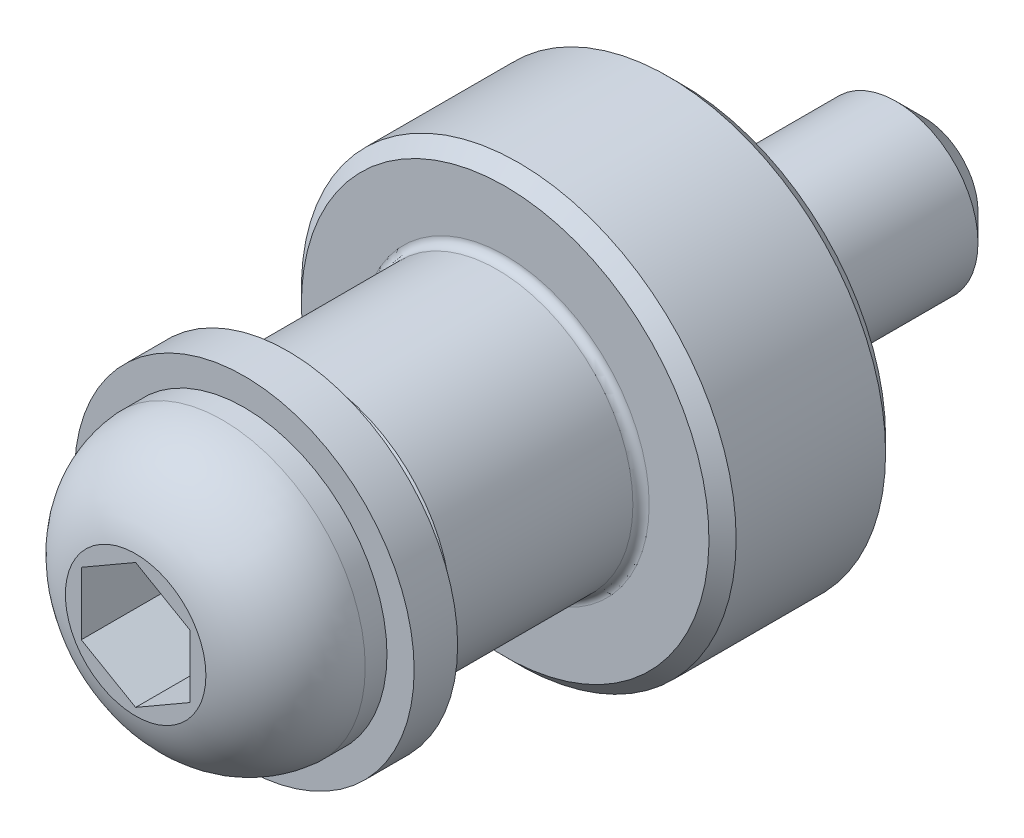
ISO-10303-21;
HEADER;
FILE_DESCRIPTION(('STEP AP214'),'2;1');
FILE_NAME('part.step','',(''),(''),'','','');
FILE_SCHEMA(('AUTOMOTIVE_DESIGN { 1 0 10303 214 1 1 1 1 }'));
ENDSEC;
DATA;
#1=APPLICATION_CONTEXT('core data for automotive mechanical design processes');
#2=APPLICATION_PROTOCOL_DEFINITION('international standard','automotive_design',2000,#1);
#3=PRODUCT_CONTEXT('',#1,'mechanical');
#4=PRODUCT('Part','Part','',(#3));
#5=PRODUCT_RELATED_PRODUCT_CATEGORY('part','',(#4));
#6=PRODUCT_DEFINITION_FORMATION('','',#4);
#7=PRODUCT_DEFINITION_CONTEXT('part definition',#1,'design');
#8=PRODUCT_DEFINITION('design','',#6,#7);
#9=PRODUCT_DEFINITION_SHAPE('','',#8);
#10=(LENGTH_UNIT() NAMED_UNIT(*) SI_UNIT(.MILLI.,.METRE.));
#11=(NAMED_UNIT(*) PLANE_ANGLE_UNIT() SI_UNIT($,.RADIAN.));
#12=(NAMED_UNIT(*) SI_UNIT($,.STERADIAN.) SOLID_ANGLE_UNIT());
#13=UNCERTAINTY_MEASURE_WITH_UNIT(LENGTH_MEASURE(1.E-05),#10,'distance_accuracy_value','');
#14=(GEOMETRIC_REPRESENTATION_CONTEXT(3) GLOBAL_UNCERTAINTY_ASSIGNED_CONTEXT((#13)) GLOBAL_UNIT_ASSIGNED_CONTEXT((#10,
#11,#12)) REPRESENTATION_CONTEXT('',''));
#15=CARTESIAN_POINT('',(0.,0.,0.));
#16=DIRECTION('',(0.,0.,1.));
#17=DIRECTION('',(1.,0.,0.));
#18=AXIS2_PLACEMENT_3D('',#15,#16,#17);
#19=CARTESIAN_POINT('',(-2.024,-2.03096452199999,-8.9));
#20=DIRECTION('',(0.,0.,1.));
#21=DIRECTION('',(1.,0.,0.));
#22=AXIS2_PLACEMENT_3D('',#19,#20,#21);
#23=PLANE('',#22);
#24=CARTESIAN_POINT('',(0.,0.,-8.9));
#25=DIRECTION('',(0.,0.,1.));
#26=DIRECTION('',(1.,0.,0.));
#27=AXIS2_PLACEMENT_3D('',#24,#25,#26);
#28=CIRCLE('',#27,1.99999999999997);
#29=CARTESIAN_POINT('',(1.99999999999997,0.,-8.9));
#30=VERTEX_POINT('',#29);
#31=EDGE_CURVE('E114',#30,#30,#28,.T.);
#32=ORIENTED_EDGE('',*,*,#31,.F.);
#33=EDGE_LOOP('',(#32));
#34=FACE_BOUND('',#33,.T.);
#35=ADVANCED_FACE('F14',(#34),#23,.F.);
#36=CARTESIAN_POINT('',(0.,0.,-8.9));
#37=DIRECTION('',(0.,0.,1.));
#38=DIRECTION('',(1.,0.,0.));
#39=AXIS2_PLACEMENT_3D('',#36,#37,#38);
#40=CONICAL_SURFACE('',#39,2.,0.785398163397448);
#41=CARTESIAN_POINT('',(0.,0.,-7.9));
#42=DIRECTION('',(0.,0.,1.));
#43=DIRECTION('',(1.,0.,0.));
#44=AXIS2_PLACEMENT_3D('',#41,#42,#43);
#45=CIRCLE('',#44,3.);
#46=CARTESIAN_POINT('',(3.,0.,-7.9));
#47=VERTEX_POINT('',#46);
#48=EDGE_CURVE('E110',#47,#47,#45,.T.);
#49=ORIENTED_EDGE('',*,*,#48,.F.);
#50=EDGE_LOOP('',(#49));
#51=FACE_BOUND('',#50,.T.);
#52=ORIENTED_EDGE('',*,*,#31,.T.);
#53=EDGE_LOOP('',(#52));
#54=FACE_BOUND('',#53,.T.);
#55=ADVANCED_FACE('F217',(#51,#54),#40,.T.);
#56=CARTESIAN_POINT('',(0.,0.,-7.9));
#57=DIRECTION('',(0.,0.,1.));
#58=DIRECTION('',(0.,-1.,0.));
#59=AXIS2_PLACEMENT_3D('',#56,#57,#58);
#60=CYLINDRICAL_SURFACE('',#59,3.);
#61=ORIENTED_EDGE('',*,*,#48,.T.);
#62=EDGE_LOOP('',(#61));
#63=FACE_BOUND('',#62,.T.);
#64=CARTESIAN_POINT('',(0.,0.,0.));
#65=DIRECTION('',(0.,0.,1.));
#66=DIRECTION('',(1.,0.,0.));
#67=AXIS2_PLACEMENT_3D('',#64,#65,#66);
#68=CIRCLE('',#67,3.);
#69=CARTESIAN_POINT('',(3.,0.,0.));
#70=VERTEX_POINT('',#69);
#71=EDGE_CURVE('E24',#70,#70,#68,.T.);
#72=ORIENTED_EDGE('',*,*,#71,.F.);
#73=EDGE_LOOP('',(#72));
#74=FACE_BOUND('',#73,.T.);
#75=ADVANCED_FACE('F214',(#63,#74),#60,.T.);
#76=CARTESIAN_POINT('',(0.,0.,14.5));
#77=DIRECTION('',(0.,0.,1.));
#78=DIRECTION('',(0.,-1.,0.));
#79=AXIS2_PLACEMENT_3D('',#76,#77,#78);
#80=CIRCLE('',#79,3.);
#81=CARTESIAN_POINT('',(0.,-3.,14.5));
#82=VERTEX_POINT('',#81);
#83=EDGE_CURVE('E113',#82,#82,#80,.F.);
#84=ORIENTED_EDGE('',*,*,#83,.T.);
#85=EDGE_LOOP('',(#84));
#86=FACE_BOUND('',#85,.T.);
#87=CARTESIAN_POINT('',(0.,0.,14.));
#88=DIRECTION('',(0.,0.,-1.));
#89=DIRECTION('',(-1.,0.,0.));
#90=AXIS2_PLACEMENT_3D('',#87,#88,#89);
#91=CIRCLE('',#90,3.);
#92=CARTESIAN_POINT('',(-3.,0.,14.));
#93=VERTEX_POINT('',#92);
#94=EDGE_CURVE('E9',#93,#93,#91,.T.);
#95=ORIENTED_EDGE('',*,*,#94,.F.);
#96=EDGE_LOOP('',(#95));
#97=FACE_BOUND('',#96,.T.);
#98=ADVANCED_FACE('F216',(#86,#97),#60,.T.);
#99=CARTESIAN_POINT('',(-6.325,-6.34676413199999,14.5));
#100=DIRECTION('',(0.,0.,1.));
#101=DIRECTION('',(1.,0.,0.));
#102=AXIS2_PLACEMENT_3D('',#99,#100,#101);
#103=PLANE('',#102);
#104=ORIENTED_EDGE('',*,*,#83,.F.);
#105=EDGE_LOOP('',(#104));
#106=FACE_BOUND('',#105,.T.);
#107=CARTESIAN_POINT('',(0.,0.,14.5));
#108=DIRECTION('',(0.,0.,1.));
#109=DIRECTION('',(1.,0.,0.));
#110=AXIS2_PLACEMENT_3D('',#107,#108,#109);
#111=CIRCLE('',#110,6.25);
#112=CARTESIAN_POINT('',(6.25,0.,14.5));
#113=VERTEX_POINT('',#112);
#114=EDGE_CURVE('E137',#113,#113,#111,.T.);
#115=ORIENTED_EDGE('',*,*,#114,.F.);
#116=EDGE_LOOP('',(#115));
#117=FACE_BOUND('',#116,.T.);
#118=ADVANCED_FACE('F225',(#106,#117),#103,.F.);
#119=CARTESIAN_POINT('',(0.,0.,14.5));
#120=DIRECTION('',(0.,0.,1.));
#121=DIRECTION('',(1.,0.,0.));
#122=AXIS2_PLACEMENT_3D('',#119,#120,#121);
#123=CYLINDRICAL_SURFACE('',#122,6.25);
#124=CARTESIAN_POINT('',(0.,0.,16.1));
#125=DIRECTION('',(0.,0.,1.));
#126=DIRECTION('',(1.,0.,0.));
#127=AXIS2_PLACEMENT_3D('',#124,#125,#126);
#128=CIRCLE('',#127,6.25);
#129=CARTESIAN_POINT('',(6.25,0.,16.1));
#130=VERTEX_POINT('',#129);
#131=EDGE_CURVE('E82',#130,#130,#128,.F.);
#132=ORIENTED_EDGE('',*,*,#131,.T.);
#133=EDGE_LOOP('',(#132));
#134=FACE_BOUND('',#133,.T.);
#135=ORIENTED_EDGE('',*,*,#114,.T.);
#136=EDGE_LOOP('',(#135));
#137=FACE_BOUND('',#136,.T.);
#138=ADVANCED_FACE('F231',(#134,#137),#123,.T.);
#139=CARTESIAN_POINT('',(-2.,-2.33711388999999,17.1));
#140=DIRECTION('',(0.,0.,1.));
#141=DIRECTION('',(1.,0.,0.));
#142=AXIS2_PLACEMENT_3D('',#139,#140,#141);
#143=PLANE('',#142);
#144=DIRECTION('',(0.866025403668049,0.500000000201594,0.));
#145=VECTOR('',#144,1.);
#146=CARTESIAN_POINT('',(1.,-1.73205080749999,17.1));
#147=LINE('',#146,#145);
#148=CARTESIAN_POINT('',(-5.64390060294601E-10,-2.30940107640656,17.1));
#149=VERTEX_POINT('',#148);
#150=CARTESIAN_POINT('',(2.,-1.15470053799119,17.1));
#151=VERTEX_POINT('',#150);
#152=EDGE_CURVE('E93',#149,#151,#147,.T.);
#153=ORIENTED_EDGE('',*,*,#152,.T.);
#154=DIRECTION('',(0.,1.,0.));
#155=VECTOR('',#154,1.);
#156=CARTESIAN_POINT('',(2.,0.,17.1));
#157=LINE('',#156,#155);
#158=CARTESIAN_POINT('',(2.,1.15470053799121,17.1));
#159=VERTEX_POINT('',#158);
#160=EDGE_CURVE('E98',#151,#159,#157,.T.);
#161=ORIENTED_EDGE('',*,*,#160,.T.);
#162=DIRECTION('',(-0.866025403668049,0.500000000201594,0.));
#163=VECTOR('',#162,1.);
#164=CARTESIAN_POINT('',(1.,1.73205080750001,17.1));
#165=LINE('',#164,#163);
#166=CARTESIAN_POINT('',(5.64390060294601E-10,2.30940107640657,17.1));
#167=VERTEX_POINT('',#166);
#168=EDGE_CURVE('E101',#159,#167,#165,.T.);
#169=ORIENTED_EDGE('',*,*,#168,.T.);
#170=DIRECTION('',(-0.866025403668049,-0.500000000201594,0.));
#171=VECTOR('',#170,1.);
#172=CARTESIAN_POINT('',(-1.,1.73205080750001,17.1));
#173=LINE('',#172,#171);
#174=CARTESIAN_POINT('',(-2.,1.15470053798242,17.1));
#175=VERTEX_POINT('',#174);
#176=EDGE_CURVE('E80',#167,#175,#173,.T.);
#177=ORIENTED_EDGE('',*,*,#176,.T.);
#178=DIRECTION('',(0.,-1.,0.));
#179=VECTOR('',#178,1.);
#180=CARTESIAN_POINT('',(-2.,0.,17.1));
#181=LINE('',#180,#179);
#182=CARTESIAN_POINT('',(-2.,-1.15470053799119,17.1));
#183=VERTEX_POINT('',#182);
#184=EDGE_CURVE('E74',#175,#183,#181,.T.);
#185=ORIENTED_EDGE('',*,*,#184,.T.);
#186=DIRECTION('',(0.866025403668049,-0.500000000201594,0.));
#187=VECTOR('',#186,1.);
#188=CARTESIAN_POINT('',(-1.,-1.73205080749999,17.1));
#189=LINE('',#188,#187);
#190=EDGE_CURVE('E77',#183,#149,#189,.T.);
#191=ORIENTED_EDGE('',*,*,#190,.T.);
#192=EDGE_LOOP('',(#153,#161,#169,#177,#185,#191));
#193=FACE_BOUND('',#192,.T.);
#194=ADVANCED_FACE('F75',(#193),#143,.T.);
#195=CARTESIAN_POINT('',(6.325,-6.34676413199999,16.1));
#196=DIRECTION('',(0.,0.,-1.));
#197=DIRECTION('',(-1.,0.,0.));
#198=AXIS2_PLACEMENT_3D('',#195,#196,#197);
#199=PLANE('',#198);
#200=CARTESIAN_POINT('',(0.,0.,16.1));
#201=DIRECTION('',(0.,0.,1.));
#202=DIRECTION('',(1.,0.,0.));
#203=AXIS2_PLACEMENT_3D('',#200,#201,#202);
#204=CIRCLE('',#203,5.25);
#205=CARTESIAN_POINT('',(5.25,0.,16.1));
#206=VERTEX_POINT('',#205);
#207=EDGE_CURVE('E124',#206,#206,#204,.T.);
#208=ORIENTED_EDGE('',*,*,#207,.F.);
#209=EDGE_LOOP('',(#208));
#210=FACE_BOUND('',#209,.T.);
#211=ORIENTED_EDGE('',*,*,#131,.F.);
#212=EDGE_LOOP('',(#211));
#213=FACE_BOUND('',#212,.T.);
#214=ADVANCED_FACE('F249',(#210,#213),#199,.F.);
#215=CARTESIAN_POINT('',(-2.,-1.15470053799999,17.1));
#216=DIRECTION('',(-1.,0.,0.));
#217=DIRECTION('',(0.,0.,1.));
#218=AXIS2_PLACEMENT_3D('',#215,#216,#217);
#219=PLANE('',#218);
#220=DIRECTION('',(0.,0.,-1.));
#221=VECTOR('',#220,1.);
#222=CARTESIAN_POINT('',(-2.,-1.15470053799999,18.6));
#223=LINE('',#222,#221);
#224=CARTESIAN_POINT('',(-2.00000000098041,-1.15470053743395,20.1));
#225=VERTEX_POINT('',#224);
#226=EDGE_CURVE('E81',#225,#183,#223,.T.);
#227=ORIENTED_EDGE('',*,*,#226,.T.);
#228=ORIENTED_EDGE('',*,*,#184,.F.);
#229=DIRECTION('',(0.,0.,1.));
#230=VECTOR('',#229,1.);
#231=CARTESIAN_POINT('',(-2.,1.15470053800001,18.6));
#232=LINE('',#231,#230);
#233=CARTESIAN_POINT('',(-2.00000000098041,1.15470053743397,20.1));
#234=VERTEX_POINT('',#233);
#235=EDGE_CURVE('E54',#175,#234,#232,.T.);
#236=ORIENTED_EDGE('',*,*,#235,.T.);
#237=DIRECTION('',(0.,-1.,0.));
#238=VECTOR('',#237,1.);
#239=CARTESIAN_POINT('',(-2.00000000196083,0.,20.1));
#240=LINE('',#239,#238);
#241=EDGE_CURVE('E48',#234,#225,#240,.T.);
#242=ORIENTED_EDGE('',*,*,#241,.T.);
#243=EDGE_LOOP('',(#227,#228,#236,#242));
#244=FACE_BOUND('',#243,.T.);
#245=ADVANCED_FACE('F84',(#244),#219,.F.);
#246=CARTESIAN_POINT('',(0.,-2.30940107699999,20.1));
#247=DIRECTION('',(-0.500000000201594,-0.866025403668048,0.));
#248=DIRECTION('',(-0.866025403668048,0.500000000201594,0.));
#249=AXIS2_PLACEMENT_3D('',#246,#247,#248);
#250=PLANE('',#249);
#251=DIRECTION('',(0.,0.,-1.));
#252=VECTOR('',#251,1.);
#253=CARTESIAN_POINT('',(0.,-2.30940107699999,18.6));
#254=LINE('',#253,#252);
#255=CARTESIAN_POINT('',(0.,-2.30940107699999,20.1));
#256=VERTEX_POINT('',#255);
#257=EDGE_CURVE('E90',#256,#149,#254,.T.);
#258=ORIENTED_EDGE('',*,*,#257,.T.);
#259=ORIENTED_EDGE('',*,*,#190,.F.);
#260=ORIENTED_EDGE('',*,*,#226,.F.);
#261=DIRECTION('',(-0.866025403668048,0.500000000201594,0.));
#262=VECTOR('',#261,1.);
#263=CARTESIAN_POINT('',(0.,-2.30940107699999,20.1));
#264=LINE('',#263,#262);
#265=EDGE_CURVE('E123',#225,#256,#264,.F.);
#266=ORIENTED_EDGE('',*,*,#265,.T.);
#267=EDGE_LOOP('',(#258,#259,#260,#266));
#268=FACE_BOUND('',#267,.T.);
#269=ADVANCED_FACE('F88',(#268),#250,.F.);
#270=CARTESIAN_POINT('',(2.,-1.15470053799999,20.1));
#271=DIRECTION('',(0.500000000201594,-0.866025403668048,0.));
#272=DIRECTION('',(-0.866025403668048,-0.500000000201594,0.));
#273=AXIS2_PLACEMENT_3D('',#270,#271,#272);
#274=PLANE('',#273);
#275=DIRECTION('',(0.,0.,-1.));
#276=VECTOR('',#275,1.);
#277=CARTESIAN_POINT('',(2.,-1.15470053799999,18.6));
#278=LINE('',#277,#276);
#279=CARTESIAN_POINT('',(2.00000000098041,-1.15470053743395,20.1));
#280=VERTEX_POINT('',#279);
#281=EDGE_CURVE('E97',#280,#151,#278,.T.);
#282=ORIENTED_EDGE('',*,*,#281,.T.);
#283=ORIENTED_EDGE('',*,*,#152,.F.);
#284=ORIENTED_EDGE('',*,*,#257,.F.);
#285=DIRECTION('',(-0.866025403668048,-0.500000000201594,0.));
#286=VECTOR('',#285,1.);
#287=CARTESIAN_POINT('',(2.,-1.15470053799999,20.1));
#288=LINE('',#287,#286);
#289=EDGE_CURVE('E117',#256,#280,#288,.F.);
#290=ORIENTED_EDGE('',*,*,#289,.T.);
#291=EDGE_LOOP('',(#282,#283,#284,#290));
#292=FACE_BOUND('',#291,.T.);
#293=ADVANCED_FACE('F257',(#292),#274,.F.);
#294=CARTESIAN_POINT('',(2.,1.15470053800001,20.1));
#295=DIRECTION('',(1.,0.,0.));
#296=DIRECTION('',(0.,-1.,0.));
#297=AXIS2_PLACEMENT_3D('',#294,#295,#296);
#298=PLANE('',#297);
#299=DIRECTION('',(0.,0.,-1.));
#300=VECTOR('',#299,1.);
#301=CARTESIAN_POINT('',(2.,1.15470053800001,18.6));
#302=LINE('',#301,#300);
#303=CARTESIAN_POINT('',(2.00000000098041,1.15470053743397,20.1));
#304=VERTEX_POINT('',#303);
#305=EDGE_CURVE('E100',#304,#159,#302,.T.);
#306=ORIENTED_EDGE('',*,*,#305,.T.);
#307=ORIENTED_EDGE('',*,*,#160,.F.);
#308=ORIENTED_EDGE('',*,*,#281,.F.);
#309=DIRECTION('',(0.,1.,0.));
#310=VECTOR('',#309,1.);
#311=CARTESIAN_POINT('',(2.00000000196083,0.,20.1));
#312=LINE('',#311,#310);
#313=EDGE_CURVE('E115',#280,#304,#312,.T.);
#314=ORIENTED_EDGE('',*,*,#313,.T.);
#315=EDGE_LOOP('',(#306,#307,#308,#314));
#316=FACE_BOUND('',#315,.T.);
#317=ADVANCED_FACE('F260',(#316),#298,.F.);
#318=CARTESIAN_POINT('',(0.,2.30940107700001,20.1));
#319=DIRECTION('',(0.500000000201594,0.866025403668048,0.));
#320=DIRECTION('',(0.866025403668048,-0.500000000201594,0.));
#321=AXIS2_PLACEMENT_3D('',#318,#319,#320);
#322=PLANE('',#321);
#323=DIRECTION('',(0.,0.,-1.));
#324=VECTOR('',#323,1.);
#325=CARTESIAN_POINT('',(0.,2.30940107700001,18.6));
#326=LINE('',#325,#324);
#327=CARTESIAN_POINT('',(0.,2.30940107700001,20.1));
#328=VERTEX_POINT('',#327);
#329=EDGE_CURVE('E103',#328,#167,#326,.T.);
#330=ORIENTED_EDGE('',*,*,#329,.T.);
#331=ORIENTED_EDGE('',*,*,#168,.F.);
#332=ORIENTED_EDGE('',*,*,#305,.F.);
#333=DIRECTION('',(0.866025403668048,-0.500000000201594,0.));
#334=VECTOR('',#333,1.);
#335=CARTESIAN_POINT('',(0.,2.30940107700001,20.1));
#336=LINE('',#335,#334);
#337=EDGE_CURVE('E33',#304,#328,#336,.F.);
#338=ORIENTED_EDGE('',*,*,#337,.T.);
#339=EDGE_LOOP('',(#330,#331,#332,#338));
#340=FACE_BOUND('',#339,.T.);
#341=ADVANCED_FACE('F264',(#340),#322,.F.);
#342=CARTESIAN_POINT('',(-2.,1.15470053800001,20.1));
#343=DIRECTION('',(-0.500000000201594,0.866025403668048,0.));
#344=DIRECTION('',(0.866025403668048,0.500000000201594,0.));
#345=AXIS2_PLACEMENT_3D('',#342,#343,#344);
#346=PLANE('',#345);
#347=ORIENTED_EDGE('',*,*,#235,.F.);
#348=ORIENTED_EDGE('',*,*,#176,.F.);
#349=ORIENTED_EDGE('',*,*,#329,.F.);
#350=DIRECTION('',(0.866025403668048,0.500000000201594,0.));
#351=VECTOR('',#350,1.);
#352=CARTESIAN_POINT('',(-2.,1.15470053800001,20.1));
#353=LINE('',#352,#351);
#354=EDGE_CURVE('E109',#328,#234,#353,.F.);
#355=ORIENTED_EDGE('',*,*,#354,.T.);
#356=EDGE_LOOP('',(#347,#348,#349,#355));
#357=FACE_BOUND('',#356,.T.);
#358=ADVANCED_FACE('F239',(#357),#346,.F.);
#359=CARTESIAN_POINT('',(0.,0.,16.1));
#360=DIRECTION('',(0.,0.,1.));
#361=DIRECTION('',(1.,0.,0.));
#362=AXIS2_PLACEMENT_3D('',#359,#360,#361);
#363=CYLINDRICAL_SURFACE('',#362,5.25);
#364=CARTESIAN_POINT('',(0.,0.,16.9));
#365=DIRECTION('',(0.,0.,1.));
#366=DIRECTION('',(0.,-1.,0.));
#367=AXIS2_PLACEMENT_3D('',#364,#365,#366);
#368=CIRCLE('',#367,5.25);
#369=CARTESIAN_POINT('',(0.,-5.24999999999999,16.9));
#370=VERTEX_POINT('',#369);
#371=EDGE_CURVE('E105',#370,#370,#368,.T.);
#372=ORIENTED_EDGE('',*,*,#371,.F.);
#373=EDGE_LOOP('',(#372));
#374=FACE_BOUND('',#373,.T.);
#375=ORIENTED_EDGE('',*,*,#207,.T.);
#376=EDGE_LOOP('',(#375));
#377=FACE_BOUND('',#376,.T.);
#378=ADVANCED_FACE('F235',(#374,#377),#363,.T.);
#379=CARTESIAN_POINT('',(2.61741792,-2.62642437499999,20.1));
#380=DIRECTION('',(0.,0.,-1.));
#381=DIRECTION('',(-1.,0.,0.));
#382=AXIS2_PLACEMENT_3D('',#379,#380,#381);
#383=PLANE('',#382);
#384=ORIENTED_EDGE('',*,*,#337,.F.);
#385=ORIENTED_EDGE('',*,*,#313,.F.);
#386=ORIENTED_EDGE('',*,*,#289,.F.);
#387=ORIENTED_EDGE('',*,*,#265,.F.);
#388=ORIENTED_EDGE('',*,*,#241,.F.);
#389=ORIENTED_EDGE('',*,*,#354,.F.);
#390=EDGE_LOOP('',(#384,#385,#386,#387,#388,#389));
#391=FACE_BOUND('',#390,.T.);
#392=CARTESIAN_POINT('',(0.,0.,20.1000000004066));
#393=DIRECTION('',(0.,0.,1.));
#394=DIRECTION('',(1.,0.,0.));
#395=AXIS2_PLACEMENT_3D('',#392,#393,#394);
#396=CIRCLE('',#395,2.58638134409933);
#397=CARTESIAN_POINT('',(2.58638134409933,0.,20.1000000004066));
#398=VERTEX_POINT('',#397);
#399=EDGE_CURVE('E108',#398,#398,#396,.F.);
#400=ORIENTED_EDGE('',*,*,#399,.F.);
#401=EDGE_LOOP('',(#400));
#402=FACE_BOUND('',#401,.T.);
#403=ADVANCED_FACE('F238',(#391,#402),#383,.F.);
#404=CARTESIAN_POINT('',(0.,0.,16.7000000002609));
#405=DIRECTION('',(0.,0.,1.));
#406=DIRECTION('',(1.,0.,0.));
#407=AXIS2_PLACEMENT_3D('',#404,#405,#406);
#408=DEGENERATE_TOROIDAL_SURFACE('',#407,1.75571895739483,3.5000000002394,.T.);
#409=ORIENTED_EDGE('',*,*,#399,.T.);
#410=EDGE_LOOP('',(#409));
#411=FACE_BOUND('',#410,.T.);
#412=ORIENTED_EDGE('',*,*,#371,.T.);
#413=EDGE_LOOP('',(#412));
#414=FACE_BOUND('',#413,.T.);
#415=ADVANCED_FACE('F227',(#411,#414),#408,.T.);
#416=CARTESIAN_POINT('',(7.59,-7.616116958,6.5));
#417=DIRECTION('',(0.,0.,-1.));
#418=DIRECTION('',(-1.,0.,0.));
#419=AXIS2_PLACEMENT_3D('',#416,#417,#418);
#420=PLANE('',#419);
#421=CARTESIAN_POINT('',(0.,0.,6.5));
#422=DIRECTION('',(0.,0.,1.));
#423=DIRECTION('',(1.,0.,0.));
#424=AXIS2_PLACEMENT_3D('',#421,#422,#423);
#425=CIRCLE('',#424,5.3);
#426=CARTESIAN_POINT('',(5.3,0.,6.5));
#427=VERTEX_POINT('',#426);
#428=EDGE_CURVE('E18',#427,#427,#425,.F.);
#429=ORIENTED_EDGE('',*,*,#428,.T.);
#430=EDGE_LOOP('',(#429));
#431=FACE_BOUND('',#430,.T.);
#432=CARTESIAN_POINT('',(0.,0.,6.5));
#433=DIRECTION('',(0.,0.,-1.));
#434=DIRECTION('',(0.,1.,0.));
#435=AXIS2_PLACEMENT_3D('',#432,#433,#434);
#436=CIRCLE('',#435,7.5);
#437=CARTESIAN_POINT('',(0.,7.5,6.5));
#438=VERTEX_POINT('',#437);
#439=EDGE_CURVE('E160',#438,#438,#436,.T.);
#440=ORIENTED_EDGE('',*,*,#439,.F.);
#441=EDGE_LOOP('',(#440));
#442=FACE_BOUND('',#441,.T.);
#443=ADVANCED_FACE('F170',(#431,#442),#420,.F.);
#444=CARTESIAN_POINT('',(0.,0.,6.5));
#445=DIRECTION('',(0.,0.,-1.));
#446=DIRECTION('',(0.,1.,0.));
#447=AXIS2_PLACEMENT_3D('',#444,#445,#446);
#448=CONICAL_SURFACE('',#447,7.5,0.785398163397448);
#449=CARTESIAN_POINT('',(0.,0.,6.));
#450=DIRECTION('',(0.,0.,1.));
#451=DIRECTION('',(1.,0.,0.));
#452=AXIS2_PLACEMENT_3D('',#449,#450,#451);
#453=CIRCLE('',#452,8.);
#454=CARTESIAN_POINT('',(8.,0.,6.));
#455=VERTEX_POINT('',#454);
#456=EDGE_CURVE('E154',#455,#455,#453,.F.);
#457=ORIENTED_EDGE('',*,*,#456,.F.);
#458=EDGE_LOOP('',(#457));
#459=FACE_BOUND('',#458,.T.);
#460=ORIENTED_EDGE('',*,*,#439,.T.);
#461=EDGE_LOOP('',(#460));
#462=FACE_BOUND('',#461,.T.);
#463=ADVANCED_FACE('F178',(#459,#462),#448,.T.);
#464=CARTESIAN_POINT('',(0.,0.,0.5));
#465=DIRECTION('',(0.,0.,1.));
#466=DIRECTION('',(1.,0.,0.));
#467=AXIS2_PLACEMENT_3D('',#464,#465,#466);
#468=CYLINDRICAL_SURFACE('',#467,8.);
#469=ORIENTED_EDGE('',*,*,#456,.T.);
#470=EDGE_LOOP('',(#469));
#471=FACE_BOUND('',#470,.T.);
#472=CARTESIAN_POINT('',(0.,0.,0.499999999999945));
#473=DIRECTION('',(0.,0.,1.));
#474=DIRECTION('',(1.,0.,0.));
#475=AXIS2_PLACEMENT_3D('',#472,#473,#474);
#476=CIRCLE('',#475,8.);
#477=CARTESIAN_POINT('',(8.,0.,0.5));
#478=VERTEX_POINT('',#477);
#479=EDGE_CURVE('E147',#478,#478,#476,.F.);
#480=ORIENTED_EDGE('',*,*,#479,.F.);
#481=EDGE_LOOP('',(#480));
#482=FACE_BOUND('',#481,.T.);
#483=ADVANCED_FACE('F185',(#471,#482),#468,.T.);
#484=CARTESIAN_POINT('',(0.,0.,0.));
#485=DIRECTION('',(0.,0.,1.));
#486=DIRECTION('',(1.,0.,0.));
#487=AXIS2_PLACEMENT_3D('',#484,#485,#486);
#488=CONICAL_SURFACE('',#487,7.5,0.785398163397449);
#489=ORIENTED_EDGE('',*,*,#479,.T.);
#490=EDGE_LOOP('',(#489));
#491=FACE_BOUND('',#490,.T.);
#492=CARTESIAN_POINT('',(0.,0.,0.));
#493=DIRECTION('',(0.,0.,1.));
#494=DIRECTION('',(1.,0.,0.));
#495=AXIS2_PLACEMENT_3D('',#492,#493,#494);
#496=CIRCLE('',#495,7.5);
#497=CARTESIAN_POINT('',(7.5,0.,0.));
#498=VERTEX_POINT('',#497);
#499=EDGE_CURVE('E144',#498,#498,#496,.T.);
#500=ORIENTED_EDGE('',*,*,#499,.T.);
#501=EDGE_LOOP('',(#500));
#502=FACE_BOUND('',#501,.T.);
#503=ADVANCED_FACE('F192',(#491,#502),#488,.T.);
#504=CARTESIAN_POINT('',(-7.59,-7.616116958,0.));
#505=DIRECTION('',(0.,0.,1.));
#506=DIRECTION('',(1.,0.,0.));
#507=AXIS2_PLACEMENT_3D('',#504,#505,#506);
#508=PLANE('',#507);
#509=ORIENTED_EDGE('',*,*,#499,.F.);
#510=EDGE_LOOP('',(#509));
#511=FACE_BOUND('',#510,.T.);
#512=ORIENTED_EDGE('',*,*,#71,.T.);
#513=EDGE_LOOP('',(#512));
#514=FACE_BOUND('',#513,.T.);
#515=ADVANCED_FACE('F16',(#511,#514),#508,.F.);
#516=CARTESIAN_POINT('',(0.,0.,6.8));
#517=DIRECTION('',(0.,0.,1.));
#518=DIRECTION('',(1.,0.,0.));
#519=AXIS2_PLACEMENT_3D('',#516,#517,#518);
#520=TOROIDAL_SURFACE('',#519,5.3,0.3);
#521=ORIENTED_EDGE('',*,*,#428,.F.);
#522=EDGE_LOOP('',(#521));
#523=FACE_BOUND('',#522,.T.);
#524=CARTESIAN_POINT('',(0.,0.,6.8));
#525=DIRECTION('',(0.,0.,1.));
#526=DIRECTION('',(1.,0.,0.));
#527=AXIS2_PLACEMENT_3D('',#524,#525,#526);
#528=CIRCLE('',#527,5.);
#529=CARTESIAN_POINT('',(5.,0.,6.8));
#530=VERTEX_POINT('',#529);
#531=EDGE_CURVE('E157',#530,#530,#528,.T.);
#532=ORIENTED_EDGE('',*,*,#531,.F.);
#533=EDGE_LOOP('',(#532));
#534=FACE_BOUND('',#533,.T.);
#535=ADVANCED_FACE('F173',(#523,#534),#520,.F.);
#536=CARTESIAN_POINT('',(0.,0.,6.8));
#537=DIRECTION('',(0.,0.,1.));
#538=DIRECTION('',(0.,-1.,0.));
#539=AXIS2_PLACEMENT_3D('',#536,#537,#538);
#540=CYLINDRICAL_SURFACE('',#539,5.);
#541=ORIENTED_EDGE('',*,*,#531,.T.);
#542=EDGE_LOOP('',(#541));
#543=FACE_BOUND('',#542,.T.);
#544=CARTESIAN_POINT('',(0.,0.,13.5));
#545=DIRECTION('',(0.,0.,-1.));
#546=DIRECTION('',(-1.,0.,0.));
#547=AXIS2_PLACEMENT_3D('',#544,#545,#546);
#548=CIRCLE('',#547,5.);
#549=CARTESIAN_POINT('',(-5.,0.,13.4999999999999));
#550=VERTEX_POINT('',#549);
#551=EDGE_CURVE('E151',#550,#550,#548,.F.);
#552=ORIENTED_EDGE('',*,*,#551,.F.);
#553=EDGE_LOOP('',(#552));
#554=FACE_BOUND('',#553,.T.);
#555=ADVANCED_FACE('F176',(#543,#554),#540,.T.);
#556=CARTESIAN_POINT('',(0.,0.,14.));
#557=DIRECTION('',(0.,0.,-1.));
#558=DIRECTION('',(0.,1.,0.));
#559=AXIS2_PLACEMENT_3D('',#556,#557,#558);
#560=CONICAL_SURFACE('',#559,4.5,0.785398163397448);
#561=CARTESIAN_POINT('',(0.,0.,14.));
#562=DIRECTION('',(0.,0.,-1.));
#563=DIRECTION('',(0.,1.,0.));
#564=AXIS2_PLACEMENT_3D('',#561,#562,#563);
#565=CIRCLE('',#564,4.5);
#566=CARTESIAN_POINT('',(0.,4.5,14.));
#567=VERTEX_POINT('',#566);
#568=EDGE_CURVE('E150',#567,#567,#565,.T.);
#569=ORIENTED_EDGE('',*,*,#568,.T.);
#570=EDGE_LOOP('',(#569));
#571=FACE_BOUND('',#570,.T.);
#572=ORIENTED_EDGE('',*,*,#551,.T.);
#573=EDGE_LOOP('',(#572));
#574=FACE_BOUND('',#573,.T.);
#575=ADVANCED_FACE('F183',(#571,#574),#560,.T.);
#576=CARTESIAN_POINT('',(4.554,-4.569670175,14.));
#577=DIRECTION('',(0.,0.,-1.));
#578=DIRECTION('',(-1.,0.,0.));
#579=AXIS2_PLACEMENT_3D('',#576,#577,#578);
#580=PLANE('',#579);
#581=ORIENTED_EDGE('',*,*,#568,.F.);
#582=EDGE_LOOP('',(#581));
#583=FACE_BOUND('',#582,.T.);
#584=ORIENTED_EDGE('',*,*,#94,.T.);
#585=EDGE_LOOP('',(#584));
#586=FACE_BOUND('',#585,.T.);
#587=ADVANCED_FACE('F189',(#583,#586),#580,.F.);
#588=CLOSED_SHELL('',(#35,#55,#75,#98,#118,#138,#194,#214,#245,#269,#293,#317,#341,#358,#378,
#403,#415,#443,#463,#483,#503,#515,#535,#555,#575,#587));
#589=MANIFOLD_SOLID_BREP('B1',#588);
#590=ADVANCED_BREP_SHAPE_REPRESENTATION('',(#18,#589),#14);
#591=SHAPE_DEFINITION_REPRESENTATION(#9,#590);
ENDSEC;
END-ISO-10303-21;
